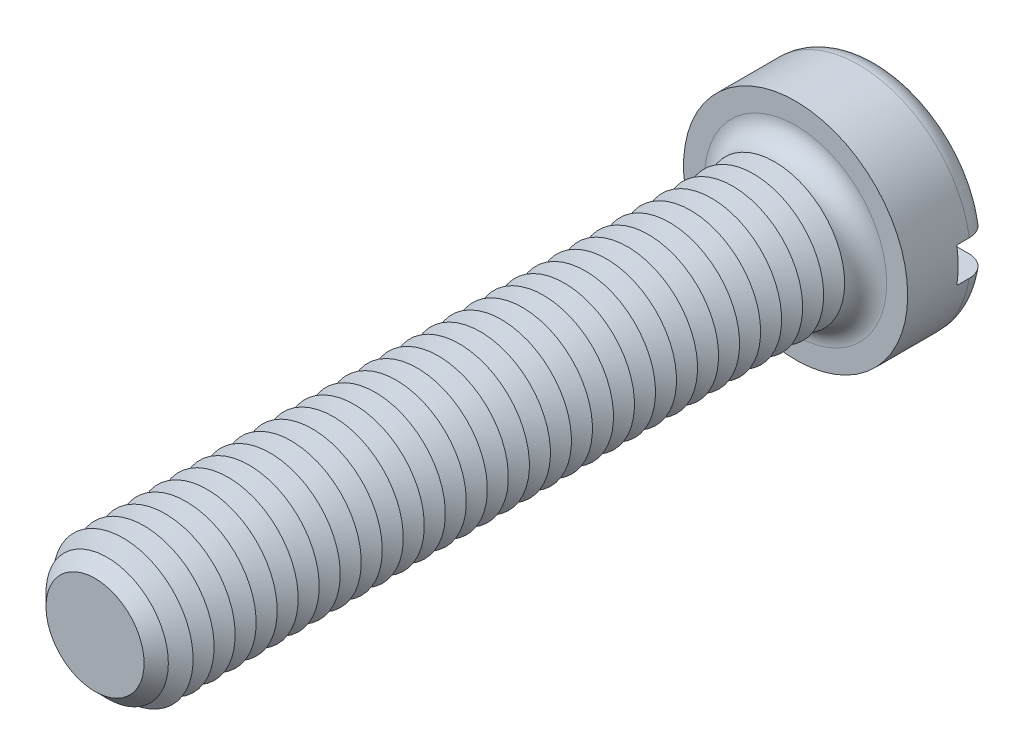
from build123d import *

# Parameters (mm, degrees)
SKETCH3_R           = 8
BOSS_EXTRUDE2_DEPTH = 6
SKETCH4_R           = 5
BOSS_EXTRUDE3_DEPTH = 50
FILLET1_R           = 1.5
CHAMFER1_SIZE       = 1.5
LPATTERN1_COUNT     = 32
LPATTERN1_PITCH     = 1.5
SKETCH8_W           = 16
SKETCH8_H           = 2.5
CUT_EXTRUDE1_DEPTH  = 2.4


with BuildPart() as part:
    # Sketch3 → Boss-Extrude2 (new body)
    with BuildSketch(Plane.XY):
        Circle(SKETCH3_R)
    extrude(amount=-BOSS_EXTRUDE2_DEPTH)

    # Sketch4 → Boss-Extrude3 (add)
    with BuildSketch(Plane.XY):
        Circle(SKETCH4_R)
    extrude(amount=BOSS_EXTRUDE3_DEPTH)

    # Fillet1
    fillet1_edges = [part.edges().sort_by_distance(p)[0] for p in [
        (-8, 0, -6),
        (-5, 0, 0),
    ]]
    fillet(fillet1_edges, radius=FILLET1_R)

    # Chamfer1
    chamfer1_edges = [part.edges().sort_by_distance(p)[0] for p in [
        (-5, 0, 50),
    ]]
    chamfer(chamfer1_edges, length=CHAMFER1_SIZE)

    # Sketch6 → Cut-Revolve1 (revolve, cut)
    with BuildSketch(Plane(origin=(0, 0, 0), x_dir=(0, 0, -1), z_dir=(1, 0, 0)), mode=Mode.PRIVATE) as cut_revolve1_sk:
        Polygon((-1.5, 5), (-2.25, 3.700961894), (-3, 5), align=None)
    cut_revolve1 = revolve(cut_revolve1_sk.sketch.rotate(Axis((0, 0, -1.694361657), (0, 0, 1)), 90), axis=Axis((0, 0, -1.694361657), (0, 0, 1)), mode=Mode.SUBTRACT)

    # LPattern1: Cut-Revolve1 ×32
    with Locations(*[(0, 0, i * LPATTERN1_PITCH) for i in range(1, LPATTERN1_COUNT)]):
        add(cut_revolve1, mode=Mode.SUBTRACT)

    # Sketch8 → Cut-Extrude1 (cut)
    with BuildSketch(Plane(origin=(0, 0, -6), x_dir=(-1, 0, 0), z_dir=(0, 0, -1))):
        Rectangle(SKETCH8_W, SKETCH8_H)
    extrude(amount=-CUT_EXTRUDE1_DEPTH, mode=Mode.SUBTRACT)


solid = part.part
